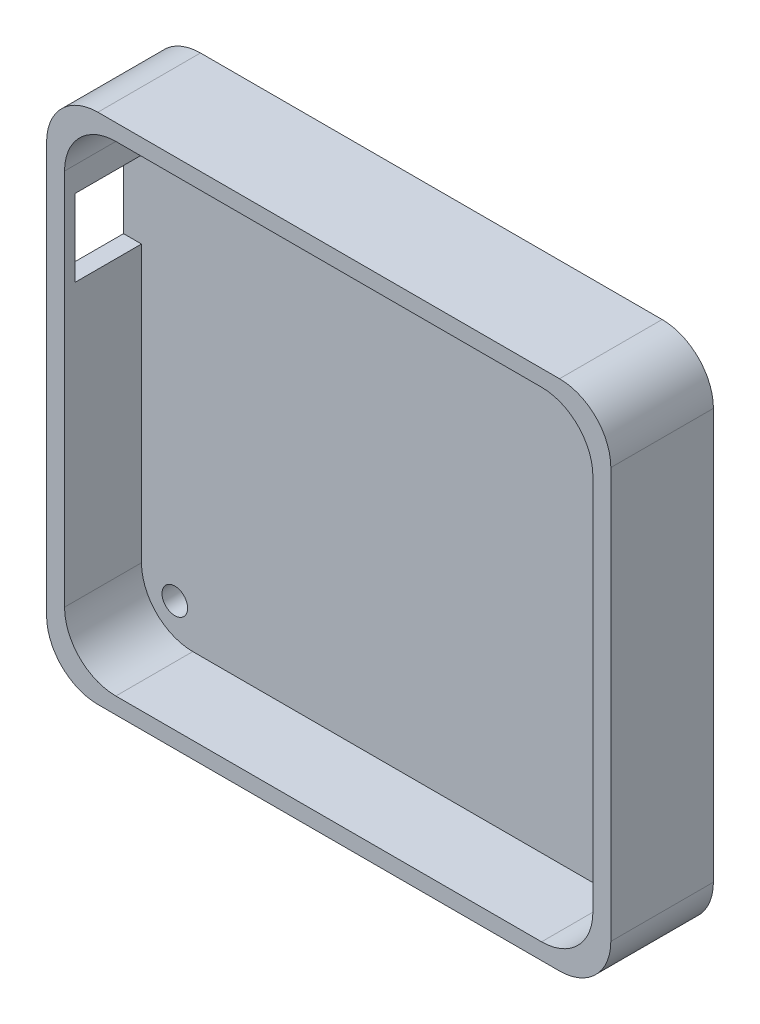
ISO-10303-21;
HEADER;
FILE_DESCRIPTION(('STEP AP214'),'2;1');
FILE_NAME('part.step','',(''),(''),'','','');
FILE_SCHEMA(('AUTOMOTIVE_DESIGN { 1 0 10303 214 1 1 1 1 }'));
ENDSEC;
DATA;
#1=APPLICATION_CONTEXT('core data for automotive mechanical design processes');
#2=APPLICATION_PROTOCOL_DEFINITION('international standard','automotive_design',2000,#1);
#3=PRODUCT_CONTEXT('',#1,'mechanical');
#4=PRODUCT('Part','Part','',(#3));
#5=PRODUCT_RELATED_PRODUCT_CATEGORY('part','',(#4));
#6=PRODUCT_DEFINITION_FORMATION('','',#4);
#7=PRODUCT_DEFINITION_CONTEXT('part definition',#1,'design');
#8=PRODUCT_DEFINITION('design','',#6,#7);
#9=PRODUCT_DEFINITION_SHAPE('','',#8);
#10=(LENGTH_UNIT() NAMED_UNIT(*) SI_UNIT(.MILLI.,.METRE.));
#11=(NAMED_UNIT(*) PLANE_ANGLE_UNIT() SI_UNIT($,.RADIAN.));
#12=(NAMED_UNIT(*) SI_UNIT($,.STERADIAN.) SOLID_ANGLE_UNIT());
#13=UNCERTAINTY_MEASURE_WITH_UNIT(LENGTH_MEASURE(1.E-05),#10,'distance_accuracy_value','');
#14=(GEOMETRIC_REPRESENTATION_CONTEXT(3) GLOBAL_UNCERTAINTY_ASSIGNED_CONTEXT((#13)) GLOBAL_UNIT_ASSIGNED_CONTEXT((#10,
#11,#12)) REPRESENTATION_CONTEXT('',''));
#15=CARTESIAN_POINT('',(0.,0.,0.));
#16=DIRECTION('',(0.,0.,1.));
#17=DIRECTION('',(1.,0.,0.));
#18=AXIS2_PLACEMENT_3D('',#15,#16,#17);
#19=CARTESIAN_POINT('',(45.,-40.,5.));
#20=DIRECTION('',(0.,0.,1.));
#21=DIRECTION('',(1.,0.,0.));
#22=AXIS2_PLACEMENT_3D('',#19,#20,#21);
#23=PLANE('',#22);
#24=DIRECTION('',(0.,1.,0.));
#25=VECTOR('',#24,1.);
#26=CARTESIAN_POINT('',(-51.5,-36.8181818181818,5.));
#27=LINE('',#26,#25);
#28=CARTESIAN_POINT('',(-51.5,32.,5.));
#29=VERTEX_POINT('',#28);
#30=CARTESIAN_POINT('',(-51.5,36.8181818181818,5.));
#31=VERTEX_POINT('',#30);
#32=EDGE_CURVE('E261',#29,#31,#27,.T.);
#33=ORIENTED_EDGE('',*,*,#32,.F.);
#34=DIRECTION('',(-1.,0.,0.));
#35=VECTOR('',#34,1.);
#36=CARTESIAN_POINT('',(-49.,32.,5.));
#37=LINE('',#36,#35);
#38=CARTESIAN_POINT('',(-55.,32.,5.));
#39=VERTEX_POINT('',#38);
#40=EDGE_CURVE('E258',#29,#39,#37,.T.);
#41=ORIENTED_EDGE('',*,*,#40,.T.);
#42=DIRECTION('',(0.,-1.,0.));
#43=VECTOR('',#42,1.);
#44=CARTESIAN_POINT('',(-55.,32.,5.));
#45=LINE('',#44,#43);
#46=CARTESIAN_POINT('',(-55.,17.,5.));
#47=VERTEX_POINT('',#46);
#48=EDGE_CURVE('E109',#39,#47,#45,.T.);
#49=ORIENTED_EDGE('',*,*,#48,.T.);
#50=DIRECTION('',(-1.,0.,0.));
#51=VECTOR('',#50,1.);
#52=CARTESIAN_POINT('',(-49.,17.,5.));
#53=LINE('',#52,#51);
#54=CARTESIAN_POINT('',(-51.5,17.,5.));
#55=VERTEX_POINT('',#54);
#56=EDGE_CURVE('E240',#55,#47,#53,.T.);
#57=ORIENTED_EDGE('',*,*,#56,.F.);
#58=CARTESIAN_POINT('',(-51.5,-36.8181818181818,5.));
#59=VERTEX_POINT('',#58);
#60=EDGE_CURVE('E296',#59,#55,#27,.T.);
#61=ORIENTED_EDGE('',*,*,#60,.F.);
#62=CARTESIAN_POINT('',(-41.5,-36.8181818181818,5.));
#63=DIRECTION('',(0.,0.,-1.));
#64=DIRECTION('',(-1.,0.,0.));
#65=AXIS2_PLACEMENT_3D('',#62,#63,#64);
#66=CIRCLE('',#65,10.);
#67=CARTESIAN_POINT('',(-41.5,-46.8181818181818,5.));
#68=VERTEX_POINT('',#67);
#69=EDGE_CURVE('E271',#68,#59,#66,.T.);
#70=ORIENTED_EDGE('',*,*,#69,.F.);
#71=DIRECTION('',(-1.,0.,0.));
#72=VECTOR('',#71,1.);
#73=CARTESIAN_POINT('',(41.5,-46.8181818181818,5.));
#74=LINE('',#73,#72);
#75=CARTESIAN_POINT('',(41.5,-46.8181818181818,5.));
#76=VERTEX_POINT('',#75);
#77=EDGE_CURVE('E316',#76,#68,#74,.T.);
#78=ORIENTED_EDGE('',*,*,#77,.F.);
#79=CARTESIAN_POINT('',(41.5,-36.8181818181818,5.));
#80=DIRECTION('',(0.,0.,1.));
#81=DIRECTION('',(1.,0.,0.));
#82=AXIS2_PLACEMENT_3D('',#79,#80,#81);
#83=CIRCLE('',#82,10.);
#84=CARTESIAN_POINT('',(51.5,-36.8181818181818,5.));
#85=VERTEX_POINT('',#84);
#86=EDGE_CURVE('E313',#76,#85,#83,.T.);
#87=ORIENTED_EDGE('',*,*,#86,.T.);
#88=DIRECTION('',(0.,1.,0.));
#89=VECTOR('',#88,1.);
#90=CARTESIAN_POINT('',(51.5,-36.8181818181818,5.));
#91=LINE('',#90,#89);
#92=CARTESIAN_POINT('',(51.5,36.8181818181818,5.));
#93=VERTEX_POINT('',#92);
#94=EDGE_CURVE('E310',#85,#93,#91,.T.);
#95=ORIENTED_EDGE('',*,*,#94,.T.);
#96=CARTESIAN_POINT('',(41.5,36.8181818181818,5.));
#97=DIRECTION('',(0.,0.,1.));
#98=DIRECTION('',(1.,0.,0.));
#99=AXIS2_PLACEMENT_3D('',#96,#97,#98);
#100=CIRCLE('',#99,10.);
#101=CARTESIAN_POINT('',(41.5,46.8181818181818,5.));
#102=VERTEX_POINT('',#101);
#103=EDGE_CURVE('E307',#93,#102,#100,.T.);
#104=ORIENTED_EDGE('',*,*,#103,.T.);
#105=DIRECTION('',(-1.,0.,0.));
#106=VECTOR('',#105,1.);
#107=CARTESIAN_POINT('',(41.5,46.8181818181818,5.));
#108=LINE('',#107,#106);
#109=CARTESIAN_POINT('',(-41.5,46.8181818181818,5.));
#110=VERTEX_POINT('',#109);
#111=EDGE_CURVE('E304',#102,#110,#108,.T.);
#112=ORIENTED_EDGE('',*,*,#111,.T.);
#113=CARTESIAN_POINT('',(-41.5,36.8181818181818,5.));
#114=DIRECTION('',(0.,0.,1.));
#115=DIRECTION('',(1.,0.,0.));
#116=AXIS2_PLACEMENT_3D('',#113,#114,#115);
#117=CIRCLE('',#116,10.);
#118=EDGE_CURVE('E300',#110,#31,#117,.T.);
#119=ORIENTED_EDGE('',*,*,#118,.T.);
#120=EDGE_LOOP('',(#33,#41,#49,#57,#61,#70,#78,#87,#95,#104,#112,#119));
#121=FACE_BOUND('',#120,.T.);
#122=CARTESIAN_POINT('',(45.,-40.,5.));
#123=DIRECTION('',(0.,0.,1.));
#124=DIRECTION('',(1.,0.,0.));
#125=AXIS2_PLACEMENT_3D('',#122,#123,#124);
#126=CIRCLE('',#125,2.50000000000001);
#127=CARTESIAN_POINT('',(47.5,-40.,5.));
#128=VERTEX_POINT('',#127);
#129=EDGE_CURVE('E395',#128,#128,#126,.T.);
#130=ORIENTED_EDGE('',*,*,#129,.F.);
#131=EDGE_LOOP('',(#130));
#132=FACE_BOUND('',#131,.T.);
#133=CARTESIAN_POINT('',(-45.,40.,5.));
#134=DIRECTION('',(0.,0.,1.));
#135=DIRECTION('',(1.,0.,0.));
#136=AXIS2_PLACEMENT_3D('',#133,#134,#135);
#137=CIRCLE('',#136,2.5);
#138=CARTESIAN_POINT('',(-42.5,40.,5.));
#139=VERTEX_POINT('',#138);
#140=EDGE_CURVE('E411',#139,#139,#137,.T.);
#141=ORIENTED_EDGE('',*,*,#140,.F.);
#142=EDGE_LOOP('',(#141));
#143=FACE_BOUND('',#142,.T.);
#144=CARTESIAN_POINT('',(-45.,-40.,5.));
#145=DIRECTION('',(0.,0.,1.));
#146=DIRECTION('',(-1.,0.,0.));
#147=AXIS2_PLACEMENT_3D('',#144,#145,#146);
#148=CIRCLE('',#147,2.50000000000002);
#149=CARTESIAN_POINT('',(-47.5,-40.,5.));
#150=VERTEX_POINT('',#149);
#151=EDGE_CURVE('E403',#150,#150,#148,.T.);
#152=ORIENTED_EDGE('',*,*,#151,.F.);
#153=EDGE_LOOP('',(#152));
#154=FACE_BOUND('',#153,.T.);
#155=CARTESIAN_POINT('',(45.,40.,5.));
#156=DIRECTION('',(0.,0.,1.));
#157=DIRECTION('',(-1.,0.,0.));
#158=AXIS2_PLACEMENT_3D('',#155,#156,#157);
#159=CIRCLE('',#158,2.5);
#160=CARTESIAN_POINT('',(42.5,40.,5.));
#161=VERTEX_POINT('',#160);
#162=EDGE_CURVE('E387',#161,#161,#159,.T.);
#163=ORIENTED_EDGE('',*,*,#162,.F.);
#164=EDGE_LOOP('',(#163));
#165=FACE_BOUND('',#164,.T.);
#166=ADVANCED_FACE('F93',(#121,#132,#143,#154,#165),#23,.T.);
#167=CARTESIAN_POINT('',(45.,-40.,0.));
#168=DIRECTION('',(0.,0.,1.));
#169=DIRECTION('',(1.,0.,0.));
#170=AXIS2_PLACEMENT_3D('',#167,#168,#169);
#171=PLANE('',#170);
#172=CARTESIAN_POINT('',(45.,-40.,0.));
#173=DIRECTION('',(0.,0.,1.));
#174=DIRECTION('',(1.,0.,0.));
#175=AXIS2_PLACEMENT_3D('',#172,#173,#174);
#176=CIRCLE('',#175,10.);
#177=CARTESIAN_POINT('',(45.,-50.,0.));
#178=VERTEX_POINT('',#177);
#179=CARTESIAN_POINT('',(55.,-40.,0.));
#180=VERTEX_POINT('',#179);
#181=EDGE_CURVE('E415',#178,#180,#176,.T.);
#182=ORIENTED_EDGE('',*,*,#181,.F.);
#183=DIRECTION('',(1.,0.,0.));
#184=VECTOR('',#183,1.);
#185=CARTESIAN_POINT('',(45.,-50.,0.));
#186=LINE('',#185,#184);
#187=CARTESIAN_POINT('',(-45.,-50.,0.));
#188=VERTEX_POINT('',#187);
#189=EDGE_CURVE('E440',#188,#178,#186,.T.);
#190=ORIENTED_EDGE('',*,*,#189,.F.);
#191=CARTESIAN_POINT('',(-45.,-40.,0.));
#192=DIRECTION('',(0.,0.,1.));
#193=DIRECTION('',(-1.,0.,0.));
#194=AXIS2_PLACEMENT_3D('',#191,#192,#193);
#195=CIRCLE('',#194,10.);
#196=CARTESIAN_POINT('',(-55.,-40.,0.));
#197=VERTEX_POINT('',#196);
#198=EDGE_CURVE('E437',#197,#188,#195,.T.);
#199=ORIENTED_EDGE('',*,*,#198,.F.);
#200=DIRECTION('',(0.,-1.,0.));
#201=VECTOR('',#200,1.);
#202=CARTESIAN_POINT('',(-55.,-40.,0.));
#203=LINE('',#202,#201);
#204=CARTESIAN_POINT('',(-55.,40.,0.));
#205=VERTEX_POINT('',#204);
#206=EDGE_CURVE('E434',#205,#197,#203,.T.);
#207=ORIENTED_EDGE('',*,*,#206,.F.);
#208=CARTESIAN_POINT('',(-45.,40.,0.));
#209=DIRECTION('',(0.,0.,1.));
#210=DIRECTION('',(1.,0.,0.));
#211=AXIS2_PLACEMENT_3D('',#208,#209,#210);
#212=CIRCLE('',#211,10.);
#213=CARTESIAN_POINT('',(-45.,50.,0.));
#214=VERTEX_POINT('',#213);
#215=EDGE_CURVE('E431',#214,#205,#212,.T.);
#216=ORIENTED_EDGE('',*,*,#215,.F.);
#217=DIRECTION('',(-1.,0.,0.));
#218=VECTOR('',#217,1.);
#219=CARTESIAN_POINT('',(45.,50.,0.));
#220=LINE('',#219,#218);
#221=CARTESIAN_POINT('',(45.,50.,0.));
#222=VERTEX_POINT('',#221);
#223=EDGE_CURVE('E428',#222,#214,#220,.T.);
#224=ORIENTED_EDGE('',*,*,#223,.F.);
#225=CARTESIAN_POINT('',(45.,40.,0.));
#226=DIRECTION('',(0.,0.,1.));
#227=DIRECTION('',(1.,0.,0.));
#228=AXIS2_PLACEMENT_3D('',#225,#226,#227);
#229=CIRCLE('',#228,10.);
#230=CARTESIAN_POINT('',(55.,40.,0.));
#231=VERTEX_POINT('',#230);
#232=EDGE_CURVE('E425',#231,#222,#229,.T.);
#233=ORIENTED_EDGE('',*,*,#232,.F.);
#234=DIRECTION('',(0.,1.,0.));
#235=VECTOR('',#234,1.);
#236=CARTESIAN_POINT('',(55.,-40.,0.));
#237=LINE('',#236,#235);
#238=EDGE_CURVE('E422',#180,#231,#237,.T.);
#239=ORIENTED_EDGE('',*,*,#238,.F.);
#240=EDGE_LOOP('',(#182,#190,#199,#207,#216,#224,#233,#239));
#241=FACE_BOUND('',#240,.T.);
#242=CARTESIAN_POINT('',(-45.,40.,0.));
#243=DIRECTION('',(0.,0.,1.));
#244=DIRECTION('',(1.,0.,0.));
#245=AXIS2_PLACEMENT_3D('',#242,#243,#244);
#246=CIRCLE('',#245,2.5);
#247=CARTESIAN_POINT('',(-42.5,40.,0.));
#248=VERTEX_POINT('',#247);
#249=EDGE_CURVE('E407',#248,#248,#246,.T.);
#250=ORIENTED_EDGE('',*,*,#249,.T.);
#251=EDGE_LOOP('',(#250));
#252=FACE_BOUND('',#251,.T.);
#253=CARTESIAN_POINT('',(-45.,-40.,0.));
#254=DIRECTION('',(0.,0.,1.));
#255=DIRECTION('',(-1.,0.,0.));
#256=AXIS2_PLACEMENT_3D('',#253,#254,#255);
#257=CIRCLE('',#256,2.50000000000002);
#258=CARTESIAN_POINT('',(-47.5,-40.,0.));
#259=VERTEX_POINT('',#258);
#260=EDGE_CURVE('E399',#259,#259,#257,.T.);
#261=ORIENTED_EDGE('',*,*,#260,.T.);
#262=EDGE_LOOP('',(#261));
#263=FACE_BOUND('',#262,.T.);
#264=CARTESIAN_POINT('',(45.,-40.,0.));
#265=DIRECTION('',(0.,0.,1.));
#266=DIRECTION('',(1.,0.,0.));
#267=AXIS2_PLACEMENT_3D('',#264,#265,#266);
#268=CIRCLE('',#267,2.50000000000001);
#269=CARTESIAN_POINT('',(47.5,-40.,0.));
#270=VERTEX_POINT('',#269);
#271=EDGE_CURVE('E391',#270,#270,#268,.T.);
#272=ORIENTED_EDGE('',*,*,#271,.T.);
#273=EDGE_LOOP('',(#272));
#274=FACE_BOUND('',#273,.T.);
#275=CARTESIAN_POINT('',(45.,40.,0.));
#276=DIRECTION('',(0.,0.,1.));
#277=DIRECTION('',(-1.,0.,0.));
#278=AXIS2_PLACEMENT_3D('',#275,#276,#277);
#279=CIRCLE('',#278,2.5);
#280=CARTESIAN_POINT('',(42.5,40.,0.));
#281=VERTEX_POINT('',#280);
#282=EDGE_CURVE('E386',#281,#281,#279,.T.);
#283=ORIENTED_EDGE('',*,*,#282,.T.);
#284=EDGE_LOOP('',(#283));
#285=FACE_BOUND('',#284,.T.);
#286=ADVANCED_FACE('F541',(#241,#252,#263,#274,#285),#171,.F.);
#287=CARTESIAN_POINT('',(45.,-40.,5.));
#288=DIRECTION('',(0.,0.,-1.));
#289=DIRECTION('',(-1.,0.,0.));
#290=AXIS2_PLACEMENT_3D('',#287,#288,#289);
#291=CYLINDRICAL_SURFACE('',#290,10.);
#292=ORIENTED_EDGE('',*,*,#181,.T.);
#293=DIRECTION('',(0.,0.,-1.));
#294=VECTOR('',#293,1.);
#295=CARTESIAN_POINT('',(55.,-40.,5.));
#296=LINE('',#295,#294);
#297=CARTESIAN_POINT('',(55.,-40.,20.));
#298=VERTEX_POINT('',#297);
#299=EDGE_CURVE('E471',#298,#180,#296,.T.);
#300=ORIENTED_EDGE('',*,*,#299,.F.);
#301=CARTESIAN_POINT('',(45.,-40.,20.));
#302=DIRECTION('',(0.,0.,1.));
#303=DIRECTION('',(1.,0.,0.));
#304=AXIS2_PLACEMENT_3D('',#301,#302,#303);
#305=CIRCLE('',#304,10.);
#306=CARTESIAN_POINT('',(45.,-50.,20.));
#307=VERTEX_POINT('',#306);
#308=EDGE_CURVE('E374',#307,#298,#305,.T.);
#309=ORIENTED_EDGE('',*,*,#308,.F.);
#310=DIRECTION('',(0.,0.,-1.));
#311=VECTOR('',#310,1.);
#312=CARTESIAN_POINT('',(45.,-50.,5.));
#313=LINE('',#312,#311);
#314=EDGE_CURVE('E443',#307,#178,#313,.T.);
#315=ORIENTED_EDGE('',*,*,#314,.T.);
#316=EDGE_LOOP('',(#292,#300,#309,#315));
#317=FACE_BOUND('',#316,.T.);
#318=ADVANCED_FACE('F95',(#317),#291,.T.);
#319=CARTESIAN_POINT('',(55.,-40.,5.));
#320=DIRECTION('',(-1.,0.,0.));
#321=DIRECTION('',(0.,0.,1.));
#322=AXIS2_PLACEMENT_3D('',#319,#320,#321);
#323=PLANE('',#322);
#324=ORIENTED_EDGE('',*,*,#238,.T.);
#325=DIRECTION('',(0.,0.,-1.));
#326=VECTOR('',#325,1.);
#327=CARTESIAN_POINT('',(55.,40.,5.));
#328=LINE('',#327,#326);
#329=CARTESIAN_POINT('',(55.,40.,20.));
#330=VERTEX_POINT('',#329);
#331=EDGE_CURVE('E467',#330,#231,#328,.T.);
#332=ORIENTED_EDGE('',*,*,#331,.F.);
#333=DIRECTION('',(0.,1.,0.));
#334=VECTOR('',#333,1.);
#335=CARTESIAN_POINT('',(55.,-40.,20.));
#336=LINE('',#335,#334);
#337=EDGE_CURVE('E370',#298,#330,#336,.T.);
#338=ORIENTED_EDGE('',*,*,#337,.F.);
#339=ORIENTED_EDGE('',*,*,#299,.T.);
#340=EDGE_LOOP('',(#324,#332,#338,#339));
#341=FACE_BOUND('',#340,.T.);
#342=ADVANCED_FACE('F534',(#341),#323,.F.);
#343=CARTESIAN_POINT('',(45.,40.,5.));
#344=DIRECTION('',(0.,0.,-1.));
#345=DIRECTION('',(-1.,0.,0.));
#346=AXIS2_PLACEMENT_3D('',#343,#344,#345);
#347=CYLINDRICAL_SURFACE('',#346,10.);
#348=ORIENTED_EDGE('',*,*,#232,.T.);
#349=DIRECTION('',(0.,0.,-1.));
#350=VECTOR('',#349,1.);
#351=CARTESIAN_POINT('',(45.,50.,5.));
#352=LINE('',#351,#350);
#353=CARTESIAN_POINT('',(45.,50.,20.));
#354=VERTEX_POINT('',#353);
#355=EDGE_CURVE('E463',#354,#222,#352,.T.);
#356=ORIENTED_EDGE('',*,*,#355,.F.);
#357=CARTESIAN_POINT('',(45.,40.,20.));
#358=DIRECTION('',(0.,0.,1.));
#359=DIRECTION('',(1.,0.,0.));
#360=AXIS2_PLACEMENT_3D('',#357,#358,#359);
#361=CIRCLE('',#360,10.);
#362=EDGE_CURVE('E366',#330,#354,#361,.T.);
#363=ORIENTED_EDGE('',*,*,#362,.F.);
#364=ORIENTED_EDGE('',*,*,#331,.T.);
#365=EDGE_LOOP('',(#348,#356,#363,#364));
#366=FACE_BOUND('',#365,.T.);
#367=ADVANCED_FACE('F537',(#366),#347,.T.);
#368=CARTESIAN_POINT('',(45.,50.,5.));
#369=DIRECTION('',(0.,-1.,0.));
#370=DIRECTION('',(1.,0.,0.));
#371=AXIS2_PLACEMENT_3D('',#368,#369,#370);
#372=PLANE('',#371);
#373=ORIENTED_EDGE('',*,*,#223,.T.);
#374=DIRECTION('',(0.,0.,-1.));
#375=VECTOR('',#374,1.);
#376=CARTESIAN_POINT('',(-45.,50.,5.));
#377=LINE('',#376,#375);
#378=CARTESIAN_POINT('',(-45.,50.,20.));
#379=VERTEX_POINT('',#378);
#380=EDGE_CURVE('E459',#379,#214,#377,.T.);
#381=ORIENTED_EDGE('',*,*,#380,.F.);
#382=DIRECTION('',(-1.,0.,0.));
#383=VECTOR('',#382,1.);
#384=CARTESIAN_POINT('',(45.,50.,20.));
#385=LINE('',#384,#383);
#386=EDGE_CURVE('E362',#354,#379,#385,.T.);
#387=ORIENTED_EDGE('',*,*,#386,.F.);
#388=ORIENTED_EDGE('',*,*,#355,.T.);
#389=EDGE_LOOP('',(#373,#381,#387,#388));
#390=FACE_BOUND('',#389,.T.);
#391=ADVANCED_FACE('F546',(#390),#372,.F.);
#392=CARTESIAN_POINT('',(-45.,40.,5.));
#393=DIRECTION('',(0.,0.,-1.));
#394=DIRECTION('',(-1.,0.,0.));
#395=AXIS2_PLACEMENT_3D('',#392,#393,#394);
#396=CYLINDRICAL_SURFACE('',#395,10.);
#397=ORIENTED_EDGE('',*,*,#215,.T.);
#398=DIRECTION('',(0.,0.,-1.));
#399=VECTOR('',#398,1.);
#400=CARTESIAN_POINT('',(-55.,40.,5.));
#401=LINE('',#400,#399);
#402=CARTESIAN_POINT('',(-55.,40.,20.));
#403=VERTEX_POINT('',#402);
#404=EDGE_CURVE('E455',#403,#205,#401,.T.);
#405=ORIENTED_EDGE('',*,*,#404,.F.);
#406=CARTESIAN_POINT('',(-45.,40.,20.));
#407=DIRECTION('',(0.,0.,1.));
#408=DIRECTION('',(1.,0.,0.));
#409=AXIS2_PLACEMENT_3D('',#406,#407,#408);
#410=CIRCLE('',#409,10.);
#411=EDGE_CURVE('E358',#379,#403,#410,.T.);
#412=ORIENTED_EDGE('',*,*,#411,.F.);
#413=ORIENTED_EDGE('',*,*,#380,.T.);
#414=EDGE_LOOP('',(#397,#405,#412,#413));
#415=FACE_BOUND('',#414,.T.);
#416=ADVANCED_FACE('F549',(#415),#396,.T.);
#417=CARTESIAN_POINT('',(-55.,-40.,5.));
#418=DIRECTION('',(1.,0.,0.));
#419=DIRECTION('',(0.,1.,0.));
#420=AXIS2_PLACEMENT_3D('',#417,#418,#419);
#421=PLANE('',#420);
#422=DIRECTION('',(0.,0.,1.));
#423=VECTOR('',#422,1.);
#424=CARTESIAN_POINT('',(-55.,17.,5.));
#425=LINE('',#424,#423);
#426=CARTESIAN_POINT('',(-55.,17.,18.));
#427=VERTEX_POINT('',#426);
#428=EDGE_CURVE('E243',#47,#427,#425,.T.);
#429=ORIENTED_EDGE('',*,*,#428,.F.);
#430=ORIENTED_EDGE('',*,*,#48,.F.);
#431=DIRECTION('',(0.,0.,-1.));
#432=VECTOR('',#431,1.);
#433=CARTESIAN_POINT('',(-55.,32.,5.));
#434=LINE('',#433,#432);
#435=CARTESIAN_POINT('',(-55.,32.,18.));
#436=VERTEX_POINT('',#435);
#437=EDGE_CURVE('E251',#436,#39,#434,.T.);
#438=ORIENTED_EDGE('',*,*,#437,.F.);
#439=DIRECTION('',(0.,1.,0.));
#440=VECTOR('',#439,1.);
#441=CARTESIAN_POINT('',(-55.,32.,18.));
#442=LINE('',#441,#440);
#443=EDGE_CURVE('E234',#427,#436,#442,.T.);
#444=ORIENTED_EDGE('',*,*,#443,.F.);
#445=EDGE_LOOP('',(#429,#430,#438,#444));
#446=FACE_BOUND('',#445,.T.);
#447=ORIENTED_EDGE('',*,*,#206,.T.);
#448=DIRECTION('',(0.,0.,-1.));
#449=VECTOR('',#448,1.);
#450=CARTESIAN_POINT('',(-55.,-40.,5.));
#451=LINE('',#450,#449);
#452=CARTESIAN_POINT('',(-55.,-40.,20.));
#453=VERTEX_POINT('',#452);
#454=EDGE_CURVE('E451',#453,#197,#451,.T.);
#455=ORIENTED_EDGE('',*,*,#454,.F.);
#456=DIRECTION('',(0.,1.,0.));
#457=VECTOR('',#456,1.);
#458=CARTESIAN_POINT('',(-55.,-40.,20.));
#459=LINE('',#458,#457);
#460=EDGE_CURVE('E327',#453,#403,#459,.T.);
#461=ORIENTED_EDGE('',*,*,#460,.T.);
#462=ORIENTED_EDGE('',*,*,#404,.T.);
#463=EDGE_LOOP('',(#447,#455,#461,#462));
#464=FACE_BOUND('',#463,.T.);
#465=ADVANCED_FACE('F248',(#446,#464),#421,.F.);
#466=CARTESIAN_POINT('',(-45.,-40.,5.));
#467=DIRECTION('',(0.,0.,-1.));
#468=DIRECTION('',(-1.,0.,0.));
#469=AXIS2_PLACEMENT_3D('',#466,#467,#468);
#470=CYLINDRICAL_SURFACE('',#469,10.);
#471=ORIENTED_EDGE('',*,*,#198,.T.);
#472=DIRECTION('',(0.,0.,-1.));
#473=VECTOR('',#472,1.);
#474=CARTESIAN_POINT('',(-45.,-50.,5.));
#475=LINE('',#474,#473);
#476=CARTESIAN_POINT('',(-45.,-50.,20.));
#477=VERTEX_POINT('',#476);
#478=EDGE_CURVE('E447',#477,#188,#475,.T.);
#479=ORIENTED_EDGE('',*,*,#478,.F.);
#480=CARTESIAN_POINT('',(-45.,-40.,20.));
#481=DIRECTION('',(0.,0.,-1.));
#482=DIRECTION('',(-1.,0.,0.));
#483=AXIS2_PLACEMENT_3D('',#480,#481,#482);
#484=CIRCLE('',#483,10.);
#485=EDGE_CURVE('E382',#477,#453,#484,.T.);
#486=ORIENTED_EDGE('',*,*,#485,.T.);
#487=ORIENTED_EDGE('',*,*,#454,.T.);
#488=EDGE_LOOP('',(#471,#479,#486,#487));
#489=FACE_BOUND('',#488,.T.);
#490=ADVANCED_FACE('F524',(#489),#470,.T.);
#491=CARTESIAN_POINT('',(45.,-50.,5.));
#492=DIRECTION('',(0.,1.,0.));
#493=DIRECTION('',(-1.,0.,0.));
#494=AXIS2_PLACEMENT_3D('',#491,#492,#493);
#495=PLANE('',#494);
#496=ORIENTED_EDGE('',*,*,#189,.T.);
#497=ORIENTED_EDGE('',*,*,#314,.F.);
#498=DIRECTION('',(-1.,0.,0.));
#499=VECTOR('',#498,1.);
#500=CARTESIAN_POINT('',(45.,-50.,20.));
#501=LINE('',#500,#499);
#502=EDGE_CURVE('E378',#307,#477,#501,.T.);
#503=ORIENTED_EDGE('',*,*,#502,.T.);
#504=ORIENTED_EDGE('',*,*,#478,.T.);
#505=EDGE_LOOP('',(#496,#497,#503,#504));
#506=FACE_BOUND('',#505,.T.);
#507=ADVANCED_FACE('F528',(#506),#495,.F.);
#508=CARTESIAN_POINT('',(-45.,40.,5.));
#509=DIRECTION('',(0.,0.,-1.));
#510=DIRECTION('',(-1.,0.,0.));
#511=AXIS2_PLACEMENT_3D('',#508,#509,#510);
#512=CYLINDRICAL_SURFACE('',#511,2.5);
#513=ORIENTED_EDGE('',*,*,#140,.T.);
#514=EDGE_LOOP('',(#513));
#515=FACE_BOUND('',#514,.T.);
#516=ORIENTED_EDGE('',*,*,#249,.F.);
#517=EDGE_LOOP('',(#516));
#518=FACE_BOUND('',#517,.T.);
#519=ADVANCED_FACE('F564',(#515,#518),#512,.F.);
#520=CARTESIAN_POINT('',(-45.,-40.,5.));
#521=DIRECTION('',(0.,0.,-1.));
#522=DIRECTION('',(-1.,0.,0.));
#523=AXIS2_PLACEMENT_3D('',#520,#521,#522);
#524=CYLINDRICAL_SURFACE('',#523,2.50000000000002);
#525=ORIENTED_EDGE('',*,*,#151,.T.);
#526=EDGE_LOOP('',(#525));
#527=FACE_BOUND('',#526,.T.);
#528=ORIENTED_EDGE('',*,*,#260,.F.);
#529=EDGE_LOOP('',(#528));
#530=FACE_BOUND('',#529,.T.);
#531=ADVANCED_FACE('F700',(#527,#530),#524,.F.);
#532=CARTESIAN_POINT('',(45.,-40.,5.));
#533=DIRECTION('',(0.,0.,-1.));
#534=DIRECTION('',(-1.,0.,0.));
#535=AXIS2_PLACEMENT_3D('',#532,#533,#534);
#536=CYLINDRICAL_SURFACE('',#535,2.50000000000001);
#537=ORIENTED_EDGE('',*,*,#129,.T.);
#538=EDGE_LOOP('',(#537));
#539=FACE_BOUND('',#538,.T.);
#540=ORIENTED_EDGE('',*,*,#271,.F.);
#541=EDGE_LOOP('',(#540));
#542=FACE_BOUND('',#541,.T.);
#543=ADVANCED_FACE('F697',(#539,#542),#536,.F.);
#544=CARTESIAN_POINT('',(45.,40.,5.));
#545=DIRECTION('',(0.,0.,-1.));
#546=DIRECTION('',(-1.,0.,0.));
#547=AXIS2_PLACEMENT_3D('',#544,#545,#546);
#548=CYLINDRICAL_SURFACE('',#547,2.5);
#549=ORIENTED_EDGE('',*,*,#162,.T.);
#550=EDGE_LOOP('',(#549));
#551=FACE_BOUND('',#550,.T.);
#552=ORIENTED_EDGE('',*,*,#282,.F.);
#553=EDGE_LOOP('',(#552));
#554=FACE_BOUND('',#553,.T.);
#555=ADVANCED_FACE('F517',(#551,#554),#548,.F.);
#556=CARTESIAN_POINT('',(-45.,40.,20.));
#557=DIRECTION('',(0.,0.,1.));
#558=DIRECTION('',(1.,0.,0.));
#559=AXIS2_PLACEMENT_3D('',#556,#557,#558);
#560=PLANE('',#559);
#561=DIRECTION('',(0.,1.,0.));
#562=VECTOR('',#561,1.);
#563=CARTESIAN_POINT('',(-51.5,-36.8181818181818,20.));
#564=LINE('',#563,#562);
#565=CARTESIAN_POINT('',(-51.5,-36.8181818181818,20.));
#566=VERTEX_POINT('',#565);
#567=CARTESIAN_POINT('',(-51.5,36.8181818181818,20.));
#568=VERTEX_POINT('',#567);
#569=EDGE_CURVE('E266',#566,#568,#564,.T.);
#570=ORIENTED_EDGE('',*,*,#569,.T.);
#571=CARTESIAN_POINT('',(-41.5,36.8181818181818,20.));
#572=DIRECTION('',(0.,0.,1.));
#573=DIRECTION('',(1.,0.,0.));
#574=AXIS2_PLACEMENT_3D('',#571,#572,#573);
#575=CIRCLE('',#574,10.);
#576=CARTESIAN_POINT('',(-41.5,46.8181818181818,20.));
#577=VERTEX_POINT('',#576);
#578=EDGE_CURVE('E270',#577,#568,#575,.T.);
#579=ORIENTED_EDGE('',*,*,#578,.F.);
#580=DIRECTION('',(-1.,0.,0.));
#581=VECTOR('',#580,1.);
#582=CARTESIAN_POINT('',(41.5,46.8181818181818,20.));
#583=LINE('',#582,#581);
#584=CARTESIAN_POINT('',(41.5,46.8181818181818,20.));
#585=VERTEX_POINT('',#584);
#586=EDGE_CURVE('E274',#585,#577,#583,.T.);
#587=ORIENTED_EDGE('',*,*,#586,.F.);
#588=CARTESIAN_POINT('',(41.5,36.8181818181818,20.));
#589=DIRECTION('',(0.,0.,1.));
#590=DIRECTION('',(1.,0.,0.));
#591=AXIS2_PLACEMENT_3D('',#588,#589,#590);
#592=CIRCLE('',#591,10.);
#593=CARTESIAN_POINT('',(51.5,36.8181818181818,20.));
#594=VERTEX_POINT('',#593);
#595=EDGE_CURVE('E278',#594,#585,#592,.T.);
#596=ORIENTED_EDGE('',*,*,#595,.F.);
#597=DIRECTION('',(0.,1.,0.));
#598=VECTOR('',#597,1.);
#599=CARTESIAN_POINT('',(51.5,-36.8181818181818,20.));
#600=LINE('',#599,#598);
#601=CARTESIAN_POINT('',(51.5,-36.8181818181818,20.));
#602=VERTEX_POINT('',#601);
#603=EDGE_CURVE('E281',#602,#594,#600,.T.);
#604=ORIENTED_EDGE('',*,*,#603,.F.);
#605=CARTESIAN_POINT('',(41.5,-36.8181818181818,20.));
#606=DIRECTION('',(0.,0.,1.));
#607=DIRECTION('',(1.,0.,0.));
#608=AXIS2_PLACEMENT_3D('',#605,#606,#607);
#609=CIRCLE('',#608,10.);
#610=CARTESIAN_POINT('',(41.5,-46.8181818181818,20.));
#611=VERTEX_POINT('',#610);
#612=EDGE_CURVE('E284',#611,#602,#609,.T.);
#613=ORIENTED_EDGE('',*,*,#612,.F.);
#614=DIRECTION('',(-1.,0.,0.));
#615=VECTOR('',#614,1.);
#616=CARTESIAN_POINT('',(41.5,-46.8181818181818,20.));
#617=LINE('',#616,#615);
#618=CARTESIAN_POINT('',(-41.5,-46.8181818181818,20.));
#619=VERTEX_POINT('',#618);
#620=EDGE_CURVE('E287',#611,#619,#617,.T.);
#621=ORIENTED_EDGE('',*,*,#620,.T.);
#622=CARTESIAN_POINT('',(-41.5,-36.8181818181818,20.));
#623=DIRECTION('',(0.,0.,-1.));
#624=DIRECTION('',(-1.,0.,0.));
#625=AXIS2_PLACEMENT_3D('',#622,#623,#624);
#626=CIRCLE('',#625,10.);
#627=EDGE_CURVE('E291',#619,#566,#626,.T.);
#628=ORIENTED_EDGE('',*,*,#627,.T.);
#629=EDGE_LOOP('',(#570,#579,#587,#596,#604,#613,#621,#628));
#630=FACE_BOUND('',#629,.T.);
#631=ORIENTED_EDGE('',*,*,#460,.F.);
#632=ORIENTED_EDGE('',*,*,#485,.F.);
#633=ORIENTED_EDGE('',*,*,#502,.F.);
#634=ORIENTED_EDGE('',*,*,#308,.T.);
#635=ORIENTED_EDGE('',*,*,#337,.T.);
#636=ORIENTED_EDGE('',*,*,#362,.T.);
#637=ORIENTED_EDGE('',*,*,#386,.T.);
#638=ORIENTED_EDGE('',*,*,#411,.T.);
#639=EDGE_LOOP('',(#631,#632,#633,#634,#635,#636,#637,#638));
#640=FACE_BOUND('',#639,.T.);
#641=ADVANCED_FACE('F514',(#630,#640),#560,.T.);
#642=CARTESIAN_POINT('',(-51.5,-36.8181818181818,20.));
#643=DIRECTION('',(-1.,0.,0.));
#644=DIRECTION('',(0.,-1.,0.));
#645=AXIS2_PLACEMENT_3D('',#642,#643,#644);
#646=PLANE('',#645);
#647=DIRECTION('',(0.,1.,0.));
#648=VECTOR('',#647,1.);
#649=CARTESIAN_POINT('',(-51.5,-36.8181818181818,18.));
#650=LINE('',#649,#648);
#651=CARTESIAN_POINT('',(-51.5,17.,18.));
#652=VERTEX_POINT('',#651);
#653=CARTESIAN_POINT('',(-51.5,32.,18.));
#654=VERTEX_POINT('',#653);
#655=EDGE_CURVE('E102',#652,#654,#650,.T.);
#656=ORIENTED_EDGE('',*,*,#655,.T.);
#657=DIRECTION('',(0.,0.,-1.));
#658=VECTOR('',#657,1.);
#659=CARTESIAN_POINT('',(-51.5,32.,20.));
#660=LINE('',#659,#658);
#661=EDGE_CURVE('E12',#654,#29,#660,.T.);
#662=ORIENTED_EDGE('',*,*,#661,.T.);
#663=ORIENTED_EDGE('',*,*,#32,.T.);
#664=DIRECTION('',(0.,0.,-1.));
#665=VECTOR('',#664,1.);
#666=CARTESIAN_POINT('',(-51.5,36.8181818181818,20.));
#667=LINE('',#666,#665);
#668=EDGE_CURVE('E295',#568,#31,#667,.T.);
#669=ORIENTED_EDGE('',*,*,#668,.F.);
#670=ORIENTED_EDGE('',*,*,#569,.F.);
#671=DIRECTION('',(0.,0.,-1.));
#672=VECTOR('',#671,1.);
#673=CARTESIAN_POINT('',(-51.5,-36.8181818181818,20.));
#674=LINE('',#673,#672);
#675=EDGE_CURVE('E323',#566,#59,#674,.T.);
#676=ORIENTED_EDGE('',*,*,#675,.T.);
#677=ORIENTED_EDGE('',*,*,#60,.T.);
#678=DIRECTION('',(0.,0.,1.));
#679=VECTOR('',#678,1.);
#680=CARTESIAN_POINT('',(-51.5,17.,20.));
#681=LINE('',#680,#679);
#682=EDGE_CURVE('E475',#55,#652,#681,.T.);
#683=ORIENTED_EDGE('',*,*,#682,.T.);
#684=EDGE_LOOP('',(#656,#662,#663,#669,#670,#676,#677,#683));
#685=FACE_BOUND('',#684,.T.);
#686=ADVANCED_FACE('F479',(#685),#646,.F.);
#687=CARTESIAN_POINT('',(-41.5,-36.8181818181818,20.));
#688=DIRECTION('',(0.,0.,-1.));
#689=DIRECTION('',(-1.,0.,0.));
#690=AXIS2_PLACEMENT_3D('',#687,#688,#689);
#691=CYLINDRICAL_SURFACE('',#690,10.);
#692=ORIENTED_EDGE('',*,*,#69,.T.);
#693=ORIENTED_EDGE('',*,*,#675,.F.);
#694=ORIENTED_EDGE('',*,*,#627,.F.);
#695=DIRECTION('',(0.,0.,-1.));
#696=VECTOR('',#695,1.);
#697=CARTESIAN_POINT('',(-41.5,-46.8181818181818,20.));
#698=LINE('',#697,#696);
#699=EDGE_CURVE('E328',#619,#68,#698,.T.);
#700=ORIENTED_EDGE('',*,*,#699,.T.);
#701=EDGE_LOOP('',(#692,#693,#694,#700));
#702=FACE_BOUND('',#701,.T.);
#703=ADVANCED_FACE('F486',(#702),#691,.F.);
#704=CARTESIAN_POINT('',(41.5,-46.8181818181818,20.));
#705=DIRECTION('',(0.,-1.,0.));
#706=DIRECTION('',(0.,0.,-1.));
#707=AXIS2_PLACEMENT_3D('',#704,#705,#706);
#708=PLANE('',#707);
#709=ORIENTED_EDGE('',*,*,#77,.T.);
#710=ORIENTED_EDGE('',*,*,#699,.F.);
#711=ORIENTED_EDGE('',*,*,#620,.F.);
#712=DIRECTION('',(0.,0.,-1.));
#713=VECTOR('',#712,1.);
#714=CARTESIAN_POINT('',(41.5,-46.8181818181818,20.));
#715=LINE('',#714,#713);
#716=EDGE_CURVE('E332',#611,#76,#715,.T.);
#717=ORIENTED_EDGE('',*,*,#716,.T.);
#718=EDGE_LOOP('',(#709,#710,#711,#717));
#719=FACE_BOUND('',#718,.T.);
#720=ADVANCED_FACE('F489',(#719),#708,.F.);
#721=CARTESIAN_POINT('',(41.5,-36.8181818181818,20.));
#722=DIRECTION('',(0.,0.,-1.));
#723=DIRECTION('',(-1.,0.,0.));
#724=AXIS2_PLACEMENT_3D('',#721,#722,#723);
#725=CYLINDRICAL_SURFACE('',#724,10.);
#726=ORIENTED_EDGE('',*,*,#86,.F.);
#727=ORIENTED_EDGE('',*,*,#716,.F.);
#728=ORIENTED_EDGE('',*,*,#612,.T.);
#729=DIRECTION('',(0.,0.,-1.));
#730=VECTOR('',#729,1.);
#731=CARTESIAN_POINT('',(51.5,-36.8181818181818,20.));
#732=LINE('',#731,#730);
#733=EDGE_CURVE('E336',#602,#85,#732,.T.);
#734=ORIENTED_EDGE('',*,*,#733,.T.);
#735=EDGE_LOOP('',(#726,#727,#728,#734));
#736=FACE_BOUND('',#735,.T.);
#737=ADVANCED_FACE('F494',(#736),#725,.F.);
#738=CARTESIAN_POINT('',(51.5,-36.8181818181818,20.));
#739=DIRECTION('',(-1.,0.,0.));
#740=DIRECTION('',(0.,-1.,0.));
#741=AXIS2_PLACEMENT_3D('',#738,#739,#740);
#742=PLANE('',#741);
#743=ORIENTED_EDGE('',*,*,#94,.F.);
#744=ORIENTED_EDGE('',*,*,#733,.F.);
#745=ORIENTED_EDGE('',*,*,#603,.T.);
#746=DIRECTION('',(0.,0.,-1.));
#747=VECTOR('',#746,1.);
#748=CARTESIAN_POINT('',(51.5,36.8181818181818,20.));
#749=LINE('',#748,#747);
#750=EDGE_CURVE('E340',#594,#93,#749,.T.);
#751=ORIENTED_EDGE('',*,*,#750,.T.);
#752=EDGE_LOOP('',(#743,#744,#745,#751));
#753=FACE_BOUND('',#752,.T.);
#754=ADVANCED_FACE('F498',(#753),#742,.T.);
#755=CARTESIAN_POINT('',(41.5,36.8181818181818,20.));
#756=DIRECTION('',(0.,0.,-1.));
#757=DIRECTION('',(-1.,0.,0.));
#758=AXIS2_PLACEMENT_3D('',#755,#756,#757);
#759=CYLINDRICAL_SURFACE('',#758,10.);
#760=ORIENTED_EDGE('',*,*,#103,.F.);
#761=ORIENTED_EDGE('',*,*,#750,.F.);
#762=ORIENTED_EDGE('',*,*,#595,.T.);
#763=DIRECTION('',(0.,0.,-1.));
#764=VECTOR('',#763,1.);
#765=CARTESIAN_POINT('',(41.5,46.8181818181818,20.));
#766=LINE('',#765,#764);
#767=EDGE_CURVE('E344',#585,#102,#766,.T.);
#768=ORIENTED_EDGE('',*,*,#767,.T.);
#769=EDGE_LOOP('',(#760,#761,#762,#768));
#770=FACE_BOUND('',#769,.T.);
#771=ADVANCED_FACE('F503',(#770),#759,.F.);
#772=CARTESIAN_POINT('',(41.5,46.8181818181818,20.));
#773=DIRECTION('',(0.,-1.,0.));
#774=DIRECTION('',(0.,0.,-1.));
#775=AXIS2_PLACEMENT_3D('',#772,#773,#774);
#776=PLANE('',#775);
#777=ORIENTED_EDGE('',*,*,#111,.F.);
#778=ORIENTED_EDGE('',*,*,#767,.F.);
#779=ORIENTED_EDGE('',*,*,#586,.T.);
#780=DIRECTION('',(0.,0.,-1.));
#781=VECTOR('',#780,1.);
#782=CARTESIAN_POINT('',(-41.5,46.8181818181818,20.));
#783=LINE('',#782,#781);
#784=EDGE_CURVE('E348',#577,#110,#783,.T.);
#785=ORIENTED_EDGE('',*,*,#784,.T.);
#786=EDGE_LOOP('',(#777,#778,#779,#785));
#787=FACE_BOUND('',#786,.T.);
#788=ADVANCED_FACE('F508',(#787),#776,.T.);
#789=CARTESIAN_POINT('',(-41.5,36.8181818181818,20.));
#790=DIRECTION('',(0.,0.,-1.));
#791=DIRECTION('',(-1.,0.,0.));
#792=AXIS2_PLACEMENT_3D('',#789,#790,#791);
#793=CYLINDRICAL_SURFACE('',#792,10.);
#794=ORIENTED_EDGE('',*,*,#118,.F.);
#795=ORIENTED_EDGE('',*,*,#784,.F.);
#796=ORIENTED_EDGE('',*,*,#578,.T.);
#797=ORIENTED_EDGE('',*,*,#668,.T.);
#798=EDGE_LOOP('',(#794,#795,#796,#797));
#799=FACE_BOUND('',#798,.T.);
#800=ADVANCED_FACE('F512',(#799),#793,.F.);
#801=CARTESIAN_POINT('',(-49.,32.,5.));
#802=DIRECTION('',(0.,1.,0.));
#803=DIRECTION('',(-1.,0.,0.));
#804=AXIS2_PLACEMENT_3D('',#801,#802,#803);
#805=PLANE('',#804);
#806=DIRECTION('',(-1.,0.,0.));
#807=VECTOR('',#806,1.);
#808=CARTESIAN_POINT('',(-49.,32.,18.));
#809=LINE('',#808,#807);
#810=EDGE_CURVE('E239',#654,#436,#809,.T.);
#811=ORIENTED_EDGE('',*,*,#810,.T.);
#812=ORIENTED_EDGE('',*,*,#437,.T.);
#813=ORIENTED_EDGE('',*,*,#40,.F.);
#814=ORIENTED_EDGE('',*,*,#661,.F.);
#815=EDGE_LOOP('',(#811,#812,#813,#814));
#816=FACE_BOUND('',#815,.T.);
#817=ADVANCED_FACE('F655',(#816),#805,.F.);
#818=CARTESIAN_POINT('',(-49.,32.,18.));
#819=DIRECTION('',(0.,0.,1.));
#820=DIRECTION('',(1.,0.,0.));
#821=AXIS2_PLACEMENT_3D('',#818,#819,#820);
#822=PLANE('',#821);
#823=DIRECTION('',(-1.,0.,0.));
#824=VECTOR('',#823,1.);
#825=CARTESIAN_POINT('',(-49.,17.,18.));
#826=LINE('',#825,#824);
#827=EDGE_CURVE('E117',#652,#427,#826,.T.);
#828=ORIENTED_EDGE('',*,*,#827,.T.);
#829=ORIENTED_EDGE('',*,*,#443,.T.);
#830=ORIENTED_EDGE('',*,*,#810,.F.);
#831=ORIENTED_EDGE('',*,*,#655,.F.);
#832=EDGE_LOOP('',(#828,#829,#830,#831));
#833=FACE_BOUND('',#832,.T.);
#834=ADVANCED_FACE('F231',(#833),#822,.F.);
#835=CARTESIAN_POINT('',(-49.,17.,5.));
#836=DIRECTION('',(0.,-1.,0.));
#837=DIRECTION('',(1.,0.,0.));
#838=AXIS2_PLACEMENT_3D('',#835,#836,#837);
#839=PLANE('',#838);
#840=ORIENTED_EDGE('',*,*,#56,.T.);
#841=ORIENTED_EDGE('',*,*,#428,.T.);
#842=ORIENTED_EDGE('',*,*,#827,.F.);
#843=ORIENTED_EDGE('',*,*,#682,.F.);
#844=EDGE_LOOP('',(#840,#841,#842,#843));
#845=FACE_BOUND('',#844,.T.);
#846=ADVANCED_FACE('F244',(#845),#839,.F.);
#847=CLOSED_SHELL('',(#166,#286,#318,#342,#367,#391,#416,#465,#490,#507,#519,#531,#543,#555,
#641,#686,#703,#720,#737,#754,#771,#788,#800,#817,#834,#846));
#848=MANIFOLD_SOLID_BREP('B2',#847);
#849=ADVANCED_BREP_SHAPE_REPRESENTATION('',(#18,#848),#14);
#850=SHAPE_DEFINITION_REPRESENTATION(#9,#849);
ENDSEC;
END-ISO-10303-21;
